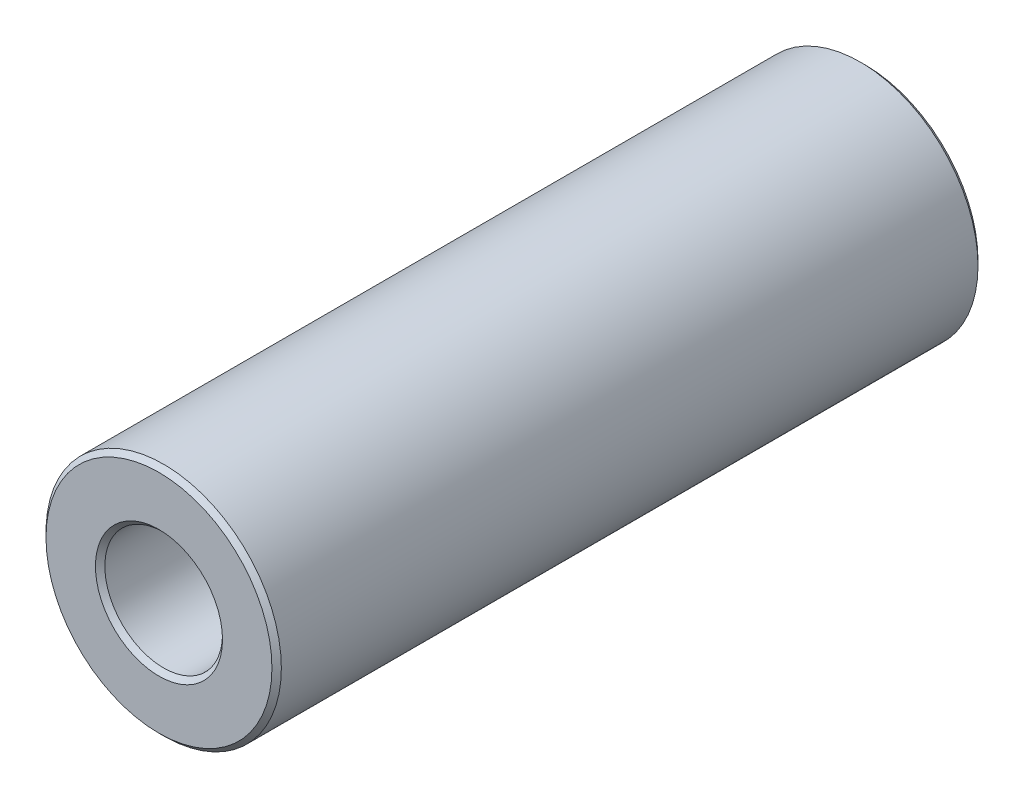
ISO-10303-21;
HEADER;
FILE_DESCRIPTION(('STEP AP214'),'2;1');
FILE_NAME('part.step','',(''),(''),'','','');
FILE_SCHEMA(('AUTOMOTIVE_DESIGN { 1 0 10303 214 1 1 1 1 }'));
ENDSEC;
DATA;
#1=APPLICATION_CONTEXT('core data for automotive mechanical design processes');
#2=APPLICATION_PROTOCOL_DEFINITION('international standard','automotive_design',2000,#1);
#3=PRODUCT_CONTEXT('',#1,'mechanical');
#4=PRODUCT('Part','Part','',(#3));
#5=PRODUCT_RELATED_PRODUCT_CATEGORY('part','',(#4));
#6=PRODUCT_DEFINITION_FORMATION('','',#4);
#7=PRODUCT_DEFINITION_CONTEXT('part definition',#1,'design');
#8=PRODUCT_DEFINITION('design','',#6,#7);
#9=PRODUCT_DEFINITION_SHAPE('','',#8);
#10=(LENGTH_UNIT() NAMED_UNIT(*) SI_UNIT(.MILLI.,.METRE.));
#11=(NAMED_UNIT(*) PLANE_ANGLE_UNIT() SI_UNIT($,.RADIAN.));
#12=(NAMED_UNIT(*) SI_UNIT($,.STERADIAN.) SOLID_ANGLE_UNIT());
#13=UNCERTAINTY_MEASURE_WITH_UNIT(LENGTH_MEASURE(1.E-05),#10,'distance_accuracy_value','');
#14=(GEOMETRIC_REPRESENTATION_CONTEXT(3) GLOBAL_UNCERTAINTY_ASSIGNED_CONTEXT((#13)) GLOBAL_UNIT_ASSIGNED_CONTEXT((#10,
#11,#12)) REPRESENTATION_CONTEXT('',''));
#15=CARTESIAN_POINT('',(0.,0.,0.));
#16=DIRECTION('',(0.,0.,1.));
#17=DIRECTION('',(1.,0.,0.));
#18=AXIS2_PLACEMENT_3D('',#15,#16,#17);
#19=CARTESIAN_POINT('',(0.,0.,7.5));
#20=DIRECTION('',(0.,0.,1.));
#21=DIRECTION('',(1.,0.,0.));
#22=AXIS2_PLACEMENT_3D('',#19,#20,#21);
#23=PLANE('',#22);
#24=CARTESIAN_POINT('',(0.,0.,7.5));
#25=DIRECTION('',(0.,0.,1.));
#26=DIRECTION('',(1.,0.,0.));
#27=AXIS2_PLACEMENT_3D('',#24,#25,#26);
#28=CIRCLE('',#27,1.35);
#29=CARTESIAN_POINT('',(1.35,0.,7.5));
#30=VERTEX_POINT('',#29);
#31=EDGE_CURVE('E10',#30,#30,#28,.F.);
#32=ORIENTED_EDGE('',*,*,#31,.T.);
#33=EDGE_LOOP('',(#32));
#34=FACE_BOUND('',#33,.T.);
#35=CARTESIAN_POINT('',(0.,0.,7.5));
#36=DIRECTION('',(0.,0.,1.));
#37=DIRECTION('',(1.,0.,0.));
#38=AXIS2_PLACEMENT_3D('',#35,#36,#37);
#39=CIRCLE('',#38,2.4);
#40=CARTESIAN_POINT('',(2.4,0.,7.5));
#41=VERTEX_POINT('',#40);
#42=EDGE_CURVE('E45',#41,#41,#39,.T.);
#43=ORIENTED_EDGE('',*,*,#42,.T.);
#44=EDGE_LOOP('',(#43));
#45=FACE_BOUND('',#44,.T.);
#46=ADVANCED_FACE('F37',(#34,#45),#23,.T.);
#47=CARTESIAN_POINT('',(0.,0.,-7.5));
#48=DIRECTION('',(0.,0.,1.));
#49=DIRECTION('',(1.,0.,0.));
#50=AXIS2_PLACEMENT_3D('',#47,#48,#49);
#51=PLANE('',#50);
#52=CARTESIAN_POINT('',(0.,0.,-7.5));
#53=DIRECTION('',(0.,0.,1.));
#54=DIRECTION('',(1.,0.,0.));
#55=AXIS2_PLACEMENT_3D('',#52,#53,#54);
#56=CIRCLE('',#55,2.4);
#57=CARTESIAN_POINT('',(2.4,0.,-7.5));
#58=VERTEX_POINT('',#57);
#59=EDGE_CURVE('E63',#58,#58,#56,.F.);
#60=ORIENTED_EDGE('',*,*,#59,.T.);
#61=EDGE_LOOP('',(#60));
#62=FACE_BOUND('',#61,.T.);
#63=CARTESIAN_POINT('',(0.,0.,-7.5));
#64=DIRECTION('',(0.,0.,1.));
#65=DIRECTION('',(1.,0.,0.));
#66=AXIS2_PLACEMENT_3D('',#63,#64,#65);
#67=CIRCLE('',#66,1.35);
#68=CARTESIAN_POINT('',(1.35,0.,-7.5));
#69=VERTEX_POINT('',#68);
#70=EDGE_CURVE('E67',#69,#69,#67,.T.);
#71=ORIENTED_EDGE('',*,*,#70,.T.);
#72=EDGE_LOOP('',(#71));
#73=FACE_BOUND('',#72,.T.);
#74=ADVANCED_FACE('F89',(#62,#73),#51,.F.);
#75=CARTESIAN_POINT('',(0.,0.,7.5));
#76=DIRECTION('',(0.,0.,-1.));
#77=DIRECTION('',(-1.,0.,0.));
#78=AXIS2_PLACEMENT_3D('',#75,#76,#77);
#79=CYLINDRICAL_SURFACE('',#78,2.5);
#80=CARTESIAN_POINT('',(0.,0.,-7.4));
#81=DIRECTION('',(0.,0.,1.));
#82=DIRECTION('',(1.,0.,0.));
#83=AXIS2_PLACEMENT_3D('',#80,#81,#82);
#84=CIRCLE('',#83,2.5);
#85=CARTESIAN_POINT('',(2.5,0.,-7.4));
#86=VERTEX_POINT('',#85);
#87=EDGE_CURVE('E70',#86,#86,#84,.T.);
#88=ORIENTED_EDGE('',*,*,#87,.T.);
#89=EDGE_LOOP('',(#88));
#90=FACE_BOUND('',#89,.T.);
#91=CARTESIAN_POINT('',(0.,0.,7.4));
#92=DIRECTION('',(0.,0.,1.));
#93=DIRECTION('',(1.,0.,0.));
#94=AXIS2_PLACEMENT_3D('',#91,#92,#93);
#95=CIRCLE('',#94,2.5);
#96=CARTESIAN_POINT('',(2.5,0.,7.4));
#97=VERTEX_POINT('',#96);
#98=EDGE_CURVE('E74',#97,#97,#95,.F.);
#99=ORIENTED_EDGE('',*,*,#98,.T.);
#100=EDGE_LOOP('',(#99));
#101=FACE_BOUND('',#100,.T.);
#102=ADVANCED_FACE('F78',(#90,#101),#79,.T.);
#103=CARTESIAN_POINT('',(0.,0.,7.5));
#104=DIRECTION('',(0.,0.,-1.));
#105=DIRECTION('',(-1.,0.,0.));
#106=AXIS2_PLACEMENT_3D('',#103,#104,#105);
#107=CYLINDRICAL_SURFACE('',#106,1.25);
#108=CARTESIAN_POINT('',(0.,0.,-7.4));
#109=DIRECTION('',(0.,0.,1.));
#110=DIRECTION('',(1.,0.,0.));
#111=AXIS2_PLACEMENT_3D('',#108,#109,#110);
#112=CIRCLE('',#111,1.25);
#113=CARTESIAN_POINT('',(1.25,0.,-7.4));
#114=VERTEX_POINT('',#113);
#115=EDGE_CURVE('E52',#114,#114,#112,.F.);
#116=ORIENTED_EDGE('',*,*,#115,.T.);
#117=EDGE_LOOP('',(#116));
#118=FACE_BOUND('',#117,.T.);
#119=CARTESIAN_POINT('',(0.,0.,7.4));
#120=DIRECTION('',(0.,0.,1.));
#121=DIRECTION('',(1.,0.,0.));
#122=AXIS2_PLACEMENT_3D('',#119,#120,#121);
#123=CIRCLE('',#122,1.25);
#124=CARTESIAN_POINT('',(1.25,0.,7.4));
#125=VERTEX_POINT('',#124);
#126=EDGE_CURVE('E57',#125,#125,#123,.T.);
#127=ORIENTED_EDGE('',*,*,#126,.T.);
#128=EDGE_LOOP('',(#127));
#129=FACE_BOUND('',#128,.T.);
#130=ADVANCED_FACE('F97',(#118,#129),#107,.F.);
#131=CARTESIAN_POINT('',(0.,0.,-7.4));
#132=DIRECTION('',(0.,0.,1.));
#133=DIRECTION('',(1.,0.,0.));
#134=AXIS2_PLACEMENT_3D('',#131,#132,#133);
#135=CONICAL_SURFACE('',#134,2.5,0.785398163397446);
#136=ORIENTED_EDGE('',*,*,#59,.F.);
#137=EDGE_LOOP('',(#136));
#138=FACE_BOUND('',#137,.T.);
#139=ORIENTED_EDGE('',*,*,#87,.F.);
#140=EDGE_LOOP('',(#139));
#141=FACE_BOUND('',#140,.T.);
#142=ADVANCED_FACE('F102',(#138,#141),#135,.T.);
#143=CARTESIAN_POINT('',(0.,0.,-7.5));
#144=DIRECTION('',(0.,0.,-1.));
#145=DIRECTION('',(-1.,0.,0.));
#146=AXIS2_PLACEMENT_3D('',#143,#144,#145);
#147=CONICAL_SURFACE('',#146,1.35,0.785398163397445);
#148=ORIENTED_EDGE('',*,*,#115,.F.);
#149=EDGE_LOOP('',(#148));
#150=FACE_BOUND('',#149,.T.);
#151=ORIENTED_EDGE('',*,*,#70,.F.);
#152=EDGE_LOOP('',(#151));
#153=FACE_BOUND('',#152,.T.);
#154=ADVANCED_FACE('F86',(#150,#153),#147,.F.);
#155=CARTESIAN_POINT('',(0.,0.,7.4));
#156=DIRECTION('',(0.,0.,1.));
#157=DIRECTION('',(1.,0.,0.));
#158=AXIS2_PLACEMENT_3D('',#155,#156,#157);
#159=CONICAL_SURFACE('',#158,1.25,0.785398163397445);
#160=ORIENTED_EDGE('',*,*,#31,.F.);
#161=EDGE_LOOP('',(#160));
#162=FACE_BOUND('',#161,.T.);
#163=ORIENTED_EDGE('',*,*,#126,.F.);
#164=EDGE_LOOP('',(#163));
#165=FACE_BOUND('',#164,.T.);
#166=ADVANCED_FACE('F82',(#162,#165),#159,.F.);
#167=CARTESIAN_POINT('',(0.,0.,7.5));
#168=DIRECTION('',(0.,0.,-1.));
#169=DIRECTION('',(-1.,0.,0.));
#170=AXIS2_PLACEMENT_3D('',#167,#168,#169);
#171=CONICAL_SURFACE('',#170,2.4,0.785398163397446);
#172=ORIENTED_EDGE('',*,*,#98,.F.);
#173=EDGE_LOOP('',(#172));
#174=FACE_BOUND('',#173,.T.);
#175=ORIENTED_EDGE('',*,*,#42,.F.);
#176=EDGE_LOOP('',(#175));
#177=FACE_BOUND('',#176,.T.);
#178=ADVANCED_FACE('F39',(#174,#177),#171,.T.);
#179=CLOSED_SHELL('',(#46,#74,#102,#130,#142,#154,#166,#178));
#180=MANIFOLD_SOLID_BREP('B2',#179);
#181=ADVANCED_BREP_SHAPE_REPRESENTATION('',(#18,#180),#14);
#182=SHAPE_DEFINITION_REPRESENTATION(#9,#181);
ENDSEC;
END-ISO-10303-21;
